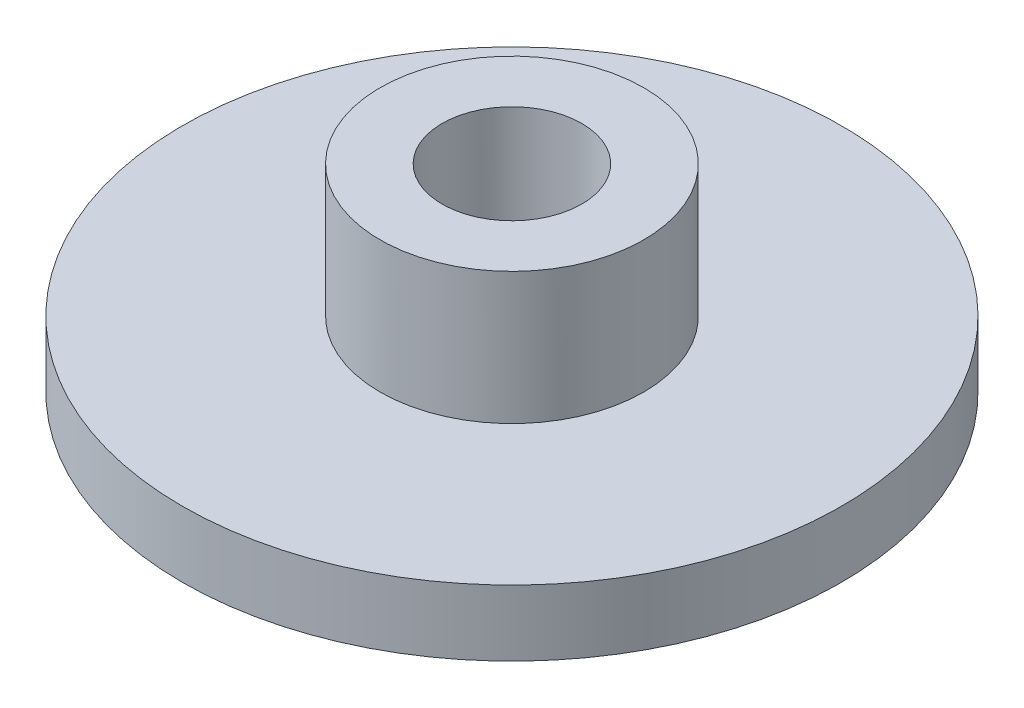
ISO-10303-21;
HEADER;
FILE_DESCRIPTION(('STEP AP214'),'2;1');
FILE_NAME('part.step','',(''),(''),'','','');
FILE_SCHEMA(('AUTOMOTIVE_DESIGN { 1 0 10303 214 1 1 1 1 }'));
ENDSEC;
DATA;
#1=APPLICATION_CONTEXT('core data for automotive mechanical design processes');
#2=APPLICATION_PROTOCOL_DEFINITION('international standard','automotive_design',2000,#1);
#3=PRODUCT_CONTEXT('',#1,'mechanical');
#4=PRODUCT('Part','Part','',(#3));
#5=PRODUCT_RELATED_PRODUCT_CATEGORY('part','',(#4));
#6=PRODUCT_DEFINITION_FORMATION('','',#4);
#7=PRODUCT_DEFINITION_CONTEXT('part definition',#1,'design');
#8=PRODUCT_DEFINITION('design','',#6,#7);
#9=PRODUCT_DEFINITION_SHAPE('','',#8);
#10=(LENGTH_UNIT() NAMED_UNIT(*) SI_UNIT(.MILLI.,.METRE.));
#11=(NAMED_UNIT(*) PLANE_ANGLE_UNIT() SI_UNIT($,.RADIAN.));
#12=(NAMED_UNIT(*) SI_UNIT($,.STERADIAN.) SOLID_ANGLE_UNIT());
#13=UNCERTAINTY_MEASURE_WITH_UNIT(LENGTH_MEASURE(1.E-05),#10,'distance_accuracy_value','');
#14=(GEOMETRIC_REPRESENTATION_CONTEXT(3) GLOBAL_UNCERTAINTY_ASSIGNED_CONTEXT((#13)) GLOBAL_UNIT_ASSIGNED_CONTEXT((#10,
#11,#12)) REPRESENTATION_CONTEXT('',''));
#15=CARTESIAN_POINT('',(0.,0.,0.));
#16=DIRECTION('',(0.,0.,1.));
#17=DIRECTION('',(1.,0.,0.));
#18=AXIS2_PLACEMENT_3D('',#15,#16,#17);
#19=CARTESIAN_POINT('',(0.,12.7,0.));
#20=DIRECTION('',(0.,1.,0.));
#21=DIRECTION('',(0.,0.,1.));
#22=AXIS2_PLACEMENT_3D('',#19,#20,#21);
#23=PLANE('',#22);
#24=CARTESIAN_POINT('',(0.,12.7,0.));
#25=DIRECTION('',(0.,1.,0.));
#26=DIRECTION('',(0.,0.,1.));
#27=AXIS2_PLACEMENT_3D('',#24,#25,#26);
#28=CIRCLE('',#27,25.4);
#29=CARTESIAN_POINT('',(0.,12.7,25.4));
#30=VERTEX_POINT('',#29);
#31=EDGE_CURVE('E10',#30,#30,#28,.T.);
#32=ORIENTED_EDGE('',*,*,#31,.F.);
#33=EDGE_LOOP('',(#32));
#34=FACE_BOUND('',#33,.T.);
#35=CARTESIAN_POINT('',(0.,12.7,0.));
#36=DIRECTION('',(0.,1.,0.));
#37=DIRECTION('',(0.,0.,1.));
#38=AXIS2_PLACEMENT_3D('',#35,#36,#37);
#39=CIRCLE('',#38,63.5);
#40=CARTESIAN_POINT('',(0.,12.7,63.5));
#41=VERTEX_POINT('',#40);
#42=EDGE_CURVE('E32',#41,#41,#39,.T.);
#43=ORIENTED_EDGE('',*,*,#42,.T.);
#44=EDGE_LOOP('',(#43));
#45=FACE_BOUND('',#44,.T.);
#46=ADVANCED_FACE('F25',(#34,#45),#23,.T.);
#47=CARTESIAN_POINT('',(0.,0.,0.));
#48=DIRECTION('',(0.,1.,0.));
#49=DIRECTION('',(0.,0.,1.));
#50=AXIS2_PLACEMENT_3D('',#47,#48,#49);
#51=PLANE('',#50);
#52=CARTESIAN_POINT('',(0.,0.,0.));
#53=DIRECTION('',(0.,1.,0.));
#54=DIRECTION('',(0.,0.,1.));
#55=AXIS2_PLACEMENT_3D('',#52,#53,#54);
#56=CIRCLE('',#55,63.5);
#57=CARTESIAN_POINT('',(0.,0.,63.5));
#58=VERTEX_POINT('',#57);
#59=EDGE_CURVE('E36',#58,#58,#56,.T.);
#60=ORIENTED_EDGE('',*,*,#59,.F.);
#61=EDGE_LOOP('',(#60));
#62=FACE_BOUND('',#61,.T.);
#63=CARTESIAN_POINT('',(0.,0.,0.));
#64=DIRECTION('',(0.,1.,0.));
#65=DIRECTION('',(0.,0.,1.));
#66=AXIS2_PLACEMENT_3D('',#63,#64,#65);
#67=CIRCLE('',#66,13.462);
#68=CARTESIAN_POINT('',(0.,0.,13.462));
#69=VERTEX_POINT('',#68);
#70=EDGE_CURVE('E40',#69,#69,#67,.T.);
#71=ORIENTED_EDGE('',*,*,#70,.T.);
#72=EDGE_LOOP('',(#71));
#73=FACE_BOUND('',#72,.T.);
#74=ADVANCED_FACE('F67',(#62,#73),#51,.F.);
#75=CARTESIAN_POINT('',(0.,12.7,0.));
#76=DIRECTION('',(0.,-1.,0.));
#77=DIRECTION('',(0.,0.,-1.));
#78=AXIS2_PLACEMENT_3D('',#75,#76,#77);
#79=CYLINDRICAL_SURFACE('',#78,63.5);
#80=ORIENTED_EDGE('',*,*,#42,.F.);
#81=EDGE_LOOP('',(#80));
#82=FACE_BOUND('',#81,.T.);
#83=ORIENTED_EDGE('',*,*,#59,.T.);
#84=EDGE_LOOP('',(#83));
#85=FACE_BOUND('',#84,.T.);
#86=ADVANCED_FACE('F27',(#82,#85),#79,.T.);
#87=CARTESIAN_POINT('',(0.,12.7,0.));
#88=DIRECTION('',(0.,-1.,0.));
#89=DIRECTION('',(0.,0.,-1.));
#90=AXIS2_PLACEMENT_3D('',#87,#88,#89);
#91=CYLINDRICAL_SURFACE('',#90,13.462);
#92=ORIENTED_EDGE('',*,*,#70,.F.);
#93=EDGE_LOOP('',(#92));
#94=FACE_BOUND('',#93,.T.);
#95=CARTESIAN_POINT('',(0.,38.1,0.));
#96=DIRECTION('',(0.,-1.,0.));
#97=DIRECTION('',(0.,0.,-1.));
#98=AXIS2_PLACEMENT_3D('',#95,#96,#97);
#99=CIRCLE('',#98,13.462);
#100=CARTESIAN_POINT('',(0.,38.1,-13.462));
#101=VERTEX_POINT('',#100);
#102=EDGE_CURVE('E48',#101,#101,#99,.T.);
#103=ORIENTED_EDGE('',*,*,#102,.F.);
#104=EDGE_LOOP('',(#103));
#105=FACE_BOUND('',#104,.T.);
#106=ADVANCED_FACE('F55',(#94,#105),#91,.F.);
#107=CARTESIAN_POINT('',(0.,38.1,0.));
#108=DIRECTION('',(0.,-1.,0.));
#109=DIRECTION('',(0.,0.,-1.));
#110=AXIS2_PLACEMENT_3D('',#107,#108,#109);
#111=CYLINDRICAL_SURFACE('',#110,25.4);
#112=CARTESIAN_POINT('',(0.,38.1,0.));
#113=DIRECTION('',(0.,-1.,0.));
#114=DIRECTION('',(0.,0.,-1.));
#115=AXIS2_PLACEMENT_3D('',#112,#113,#114);
#116=CIRCLE('',#115,25.4);
#117=CARTESIAN_POINT('',(0.,38.1,-25.4));
#118=VERTEX_POINT('',#117);
#119=EDGE_CURVE('E45',#118,#118,#116,.T.);
#120=ORIENTED_EDGE('',*,*,#119,.T.);
#121=EDGE_LOOP('',(#120));
#122=FACE_BOUND('',#121,.T.);
#123=ORIENTED_EDGE('',*,*,#31,.T.);
#124=EDGE_LOOP('',(#123));
#125=FACE_BOUND('',#124,.T.);
#126=ADVANCED_FACE('F57',(#122,#125),#111,.T.);
#127=CARTESIAN_POINT('',(0.,38.1,0.));
#128=DIRECTION('',(0.,-1.,0.));
#129=DIRECTION('',(0.,0.,-1.));
#130=AXIS2_PLACEMENT_3D('',#127,#128,#129);
#131=PLANE('',#130);
#132=ORIENTED_EDGE('',*,*,#102,.T.);
#133=EDGE_LOOP('',(#132));
#134=FACE_BOUND('',#133,.T.);
#135=ORIENTED_EDGE('',*,*,#119,.F.);
#136=EDGE_LOOP('',(#135));
#137=FACE_BOUND('',#136,.T.);
#138=ADVANCED_FACE('F52',(#134,#137),#131,.F.);
#139=CLOSED_SHELL('',(#46,#74,#86,#106,#126,#138));
#140=MANIFOLD_SOLID_BREP('B2',#139);
#141=ADVANCED_BREP_SHAPE_REPRESENTATION('',(#18,#140),#14);
#142=SHAPE_DEFINITION_REPRESENTATION(#9,#141);
ENDSEC;
END-ISO-10303-21;
